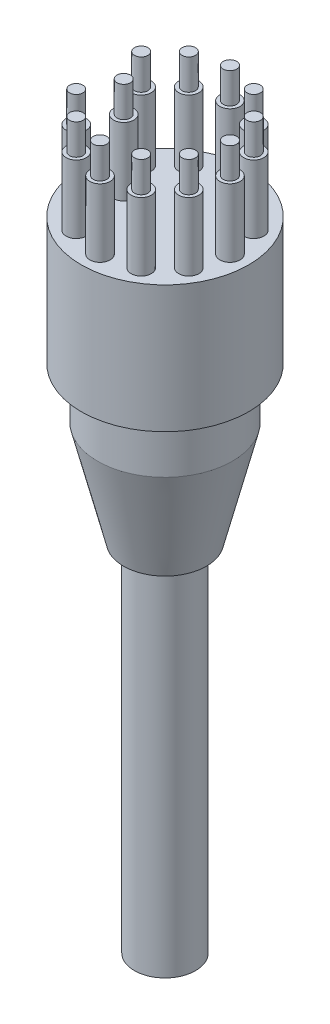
ISO-10303-21;
HEADER;
FILE_DESCRIPTION(('STEP AP214'),'2;1');
FILE_NAME('part.step','',(''),(''),'','','');
FILE_SCHEMA(('AUTOMOTIVE_DESIGN { 1 0 10303 214 1 1 1 1 }'));
ENDSEC;
DATA;
#1=APPLICATION_CONTEXT('core data for automotive mechanical design processes');
#2=APPLICATION_PROTOCOL_DEFINITION('international standard','automotive_design',2000,#1);
#3=PRODUCT_CONTEXT('',#1,'mechanical');
#4=PRODUCT('Part','Part','',(#3));
#5=PRODUCT_RELATED_PRODUCT_CATEGORY('part','',(#4));
#6=PRODUCT_DEFINITION_FORMATION('','',#4);
#7=PRODUCT_DEFINITION_CONTEXT('part definition',#1,'design');
#8=PRODUCT_DEFINITION('design','',#6,#7);
#9=PRODUCT_DEFINITION_SHAPE('','',#8);
#10=(LENGTH_UNIT() NAMED_UNIT(*) SI_UNIT(.MILLI.,.METRE.));
#11=(NAMED_UNIT(*) PLANE_ANGLE_UNIT() SI_UNIT($,.RADIAN.));
#12=(NAMED_UNIT(*) SI_UNIT($,.STERADIAN.) SOLID_ANGLE_UNIT());
#13=UNCERTAINTY_MEASURE_WITH_UNIT(LENGTH_MEASURE(1.E-05),#10,'distance_accuracy_value','');
#14=(GEOMETRIC_REPRESENTATION_CONTEXT(3) GLOBAL_UNCERTAINTY_ASSIGNED_CONTEXT((#13)) GLOBAL_UNIT_ASSIGNED_CONTEXT((#10,
#11,#12)) REPRESENTATION_CONTEXT('',''));
#15=CARTESIAN_POINT('',(0.,0.,0.));
#16=DIRECTION('',(0.,0.,1.));
#17=DIRECTION('',(1.,0.,0.));
#18=AXIS2_PLACEMENT_3D('',#15,#16,#17);
#19=CARTESIAN_POINT('',(0.,-15.5194,0.));
#20=DIRECTION('',(0.,-1.,0.));
#21=DIRECTION('',(0.,0.,-1.));
#22=AXIS2_PLACEMENT_3D('',#19,#20,#21);
#23=PLANE('',#22);
#24=CARTESIAN_POINT('',(0.,-15.5194,0.));
#25=DIRECTION('',(0.,-1.,0.));
#26=DIRECTION('',(0.,0.,-1.));
#27=AXIS2_PLACEMENT_3D('',#24,#25,#26);
#28=CIRCLE('',#27,6.18897899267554);
#29=CARTESIAN_POINT('',(0.,-15.5194,-6.18897899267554));
#30=VERTEX_POINT('',#29);
#31=EDGE_CURVE('E193',#30,#30,#28,.T.);
#32=ORIENTED_EDGE('',*,*,#31,.T.);
#33=EDGE_LOOP('',(#32));
#34=FACE_BOUND('',#33,.T.);
#35=CARTESIAN_POINT('',(0.,-15.5194,0.));
#36=DIRECTION('',(0.,-1.,0.));
#37=DIRECTION('',(0.,0.,-1.));
#38=AXIS2_PLACEMENT_3D('',#35,#36,#37);
#39=CIRCLE('',#38,4.572);
#40=CARTESIAN_POINT('',(0.,-15.5194,-4.572));
#41=VERTEX_POINT('',#40);
#42=EDGE_CURVE('E202',#41,#41,#39,.T.);
#43=ORIENTED_EDGE('',*,*,#42,.F.);
#44=EDGE_LOOP('',(#43));
#45=FACE_BOUND('',#44,.T.);
#46=ADVANCED_FACE('F34',(#34,#45),#23,.T.);
#47=CARTESIAN_POINT('',(-6.16752935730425,36.78,0.));
#48=DIRECTION('',(0.,1.,0.));
#49=DIRECTION('',(0.,0.,1.));
#50=AXIS2_PLACEMENT_3D('',#47,#48,#49);
#51=PLANE('',#50);
#52=CARTESIAN_POINT('',(-6.16752935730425,36.78,0.));
#53=DIRECTION('',(0.,1.,0.));
#54=DIRECTION('',(0.,0.,1.));
#55=AXIS2_PLACEMENT_3D('',#52,#53,#54);
#56=CIRCLE('',#55,1.5113);
#57=CARTESIAN_POINT('',(-6.16752935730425,36.78,1.5113));
#58=VERTEX_POINT('',#57);
#59=EDGE_CURVE('E181',#58,#58,#56,.T.);
#60=ORIENTED_EDGE('',*,*,#59,.T.);
#61=EDGE_LOOP('',(#60));
#62=FACE_BOUND('',#61,.T.);
#63=CARTESIAN_POINT('',(-6.16752935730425,36.78,0.));
#64=DIRECTION('',(0.,1.,0.));
#65=DIRECTION('',(0.,0.,1.));
#66=AXIS2_PLACEMENT_3D('',#63,#64,#65);
#67=CIRCLE('',#66,1.0033);
#68=CARTESIAN_POINT('',(-6.16752935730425,36.78,1.0033));
#69=VERTEX_POINT('',#68);
#70=EDGE_CURVE('E190',#69,#69,#67,.T.);
#71=ORIENTED_EDGE('',*,*,#70,.F.);
#72=EDGE_LOOP('',(#71));
#73=FACE_BOUND('',#72,.T.);
#74=ADVANCED_FACE('F218',(#62,#73),#51,.T.);
#75=CARTESIAN_POINT('',(0.,26.62,0.));
#76=DIRECTION('',(0.,1.,0.));
#77=DIRECTION('',(0.,0.,1.));
#78=AXIS2_PLACEMENT_3D('',#75,#76,#77);
#79=PLANE('',#78);
#80=CARTESIAN_POINT('',(8.40585907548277,26.62,-4.85312499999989));
#81=DIRECTION('',(0.,1.,0.));
#82=DIRECTION('',(0.499999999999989,0.,0.866025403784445));
#83=AXIS2_PLACEMENT_3D('',#80,#81,#82);
#84=CIRCLE('',#83,1.5113);
#85=CARTESIAN_POINT('',(9.16150907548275,26.62,-3.54430080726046));
#86=VERTEX_POINT('',#85);
#87=EDGE_CURVE('E118',#86,#86,#84,.T.);
#88=ORIENTED_EDGE('',*,*,#87,.F.);
#89=EDGE_LOOP('',(#88));
#90=FACE_BOUND('',#89,.T.);
#91=CARTESIAN_POINT('',(1.01667631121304E-13,26.62,-9.70625));
#92=DIRECTION('',(0.,1.,0.));
#93=DIRECTION('',(1.,0.,0.));
#94=AXIS2_PLACEMENT_3D('',#91,#92,#93);
#95=CIRCLE('',#94,1.5113);
#96=CARTESIAN_POINT('',(1.5113000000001,26.62,-9.70624999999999));
#97=VERTEX_POINT('',#96);
#98=EDGE_CURVE('E106',#97,#97,#95,.T.);
#99=ORIENTED_EDGE('',*,*,#98,.F.);
#100=EDGE_LOOP('',(#99));
#101=FACE_BOUND('',#100,.T.);
#102=CARTESIAN_POINT('',(-8.40585907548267,26.62,-4.85312500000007));
#103=DIRECTION('',(0.,1.,0.));
#104=DIRECTION('',(0.500000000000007,0.,-0.866025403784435));
#105=AXIS2_PLACEMENT_3D('',#102,#103,#104);
#106=CIRCLE('',#105,1.5113);
#107=CARTESIAN_POINT('',(-7.65020907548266,26.62,-6.16194919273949));
#108=VERTEX_POINT('',#107);
#109=EDGE_CURVE('E94',#108,#108,#106,.T.);
#110=ORIENTED_EDGE('',*,*,#109,.F.);
#111=EDGE_LOOP('',(#110));
#112=FACE_BOUND('',#111,.T.);
#113=CARTESIAN_POINT('',(-4.85312500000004,26.62,8.40585907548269));
#114=DIRECTION('',(0.,1.,0.));
#115=DIRECTION('',(-0.866025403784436,0.,-0.500000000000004));
#116=AXIS2_PLACEMENT_3D('',#113,#114,#115);
#117=CIRCLE('',#116,1.5113);
#118=CARTESIAN_POINT('',(-6.16194919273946,26.62,7.65020907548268));
#119=VERTEX_POINT('',#118);
#120=EDGE_CURVE('E82',#119,#119,#117,.T.);
#121=ORIENTED_EDGE('',*,*,#120,.F.);
#122=EDGE_LOOP('',(#121));
#123=FACE_BOUND('',#122,.T.);
#124=CARTESIAN_POINT('',(4.85312499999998,26.62,8.40585907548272));
#125=DIRECTION('',(0.,1.,0.));
#126=DIRECTION('',(-0.86602540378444,0.,0.499999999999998));
#127=AXIS2_PLACEMENT_3D('',#124,#125,#126);
#128=CIRCLE('',#127,1.5113);
#129=CARTESIAN_POINT('',(3.54430080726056,26.62,9.16150907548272));
#130=VERTEX_POINT('',#129);
#131=EDGE_CURVE('E70',#130,#130,#128,.T.);
#132=ORIENTED_EDGE('',*,*,#131,.F.);
#133=EDGE_LOOP('',(#132));
#134=FACE_BOUND('',#133,.T.);
#135=CARTESIAN_POINT('',(9.70625,26.62,0.));
#136=DIRECTION('',(0.,1.,0.));
#137=DIRECTION('',(0.,0.,1.));
#138=AXIS2_PLACEMENT_3D('',#135,#136,#137);
#139=CIRCLE('',#138,1.5113);
#140=CARTESIAN_POINT('',(9.70625,26.62,1.5113));
#141=VERTEX_POINT('',#140);
#142=EDGE_CURVE('E52',#141,#141,#139,.T.);
#143=ORIENTED_EDGE('',*,*,#142,.F.);
#144=EDGE_LOOP('',(#143));
#145=FACE_BOUND('',#144,.T.);
#146=CARTESIAN_POINT('',(0.,26.62,0.));
#147=DIRECTION('',(0.,1.,0.));
#148=DIRECTION('',(0.,0.,1.));
#149=AXIS2_PLACEMENT_3D('',#146,#147,#148);
#150=CIRCLE('',#149,12.5);
#151=CARTESIAN_POINT('',(0.,26.62,12.5));
#152=VERTEX_POINT('',#151);
#153=EDGE_CURVE('E41',#152,#152,#150,.T.);
#154=ORIENTED_EDGE('',*,*,#153,.T.);
#155=EDGE_LOOP('',(#154));
#156=FACE_BOUND('',#155,.T.);
#157=CARTESIAN_POINT('',(8.4058590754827,26.62,4.85312500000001));
#158=DIRECTION('',(0.,1.,0.));
#159=DIRECTION('',(-0.500000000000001,0.,0.866025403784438));
#160=AXIS2_PLACEMENT_3D('',#157,#158,#159);
#161=CIRCLE('',#160,1.5113);
#162=CARTESIAN_POINT('',(7.6502090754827,26.62,6.16194919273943));
#163=VERTEX_POINT('',#162);
#164=EDGE_CURVE('E64',#163,#163,#161,.T.);
#165=ORIENTED_EDGE('',*,*,#164,.F.);
#166=EDGE_LOOP('',(#165));
#167=FACE_BOUND('',#166,.T.);
#168=CARTESIAN_POINT('',(0.,26.62,9.70625));
#169=DIRECTION('',(0.,1.,0.));
#170=DIRECTION('',(-1.,0.,0.));
#171=AXIS2_PLACEMENT_3D('',#168,#169,#170);
#172=CIRCLE('',#171,1.5113);
#173=CARTESIAN_POINT('',(-1.51130000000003,26.62,9.70625));
#174=VERTEX_POINT('',#173);
#175=EDGE_CURVE('E76',#174,#174,#172,.T.);
#176=ORIENTED_EDGE('',*,*,#175,.F.);
#177=EDGE_LOOP('',(#176));
#178=FACE_BOUND('',#177,.T.);
#179=CARTESIAN_POINT('',(-8.40585907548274,26.62,4.85312499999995));
#180=DIRECTION('',(0.,1.,0.));
#181=DIRECTION('',(-0.499999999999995,0.,-0.866025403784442));
#182=AXIS2_PLACEMENT_3D('',#179,#180,#181);
#183=CIRCLE('',#182,1.5113);
#184=CARTESIAN_POINT('',(-9.16150907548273,26.62,3.54430080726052));
#185=VERTEX_POINT('',#184);
#186=EDGE_CURVE('E88',#185,#185,#183,.T.);
#187=ORIENTED_EDGE('',*,*,#186,.F.);
#188=EDGE_LOOP('',(#187));
#189=FACE_BOUND('',#188,.T.);
#190=CARTESIAN_POINT('',(-4.85312499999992,26.62,-8.40585907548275));
#191=DIRECTION('',(0.,1.,0.));
#192=DIRECTION('',(0.866025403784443,0.,-0.499999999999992));
#193=AXIS2_PLACEMENT_3D('',#190,#191,#192);
#194=CIRCLE('',#193,1.5113);
#195=CARTESIAN_POINT('',(-3.54430080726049,26.62,-9.16150907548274));
#196=VERTEX_POINT('',#195);
#197=EDGE_CURVE('E100',#196,#196,#194,.T.);
#198=ORIENTED_EDGE('',*,*,#197,.F.);
#199=EDGE_LOOP('',(#198));
#200=FACE_BOUND('',#199,.T.);
#201=CARTESIAN_POINT('',(4.8531250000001,26.62,-8.40585907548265));
#202=DIRECTION('',(0.,1.,0.));
#203=DIRECTION('',(0.866025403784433,0.,0.50000000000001));
#204=AXIS2_PLACEMENT_3D('',#201,#202,#203);
#205=CIRCLE('',#204,1.5113);
#206=CARTESIAN_POINT('',(6.16194919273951,26.62,-7.65020907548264));
#207=VERTEX_POINT('',#206);
#208=EDGE_CURVE('E112',#207,#207,#205,.T.);
#209=ORIENTED_EDGE('',*,*,#208,.F.);
#210=EDGE_LOOP('',(#209));
#211=FACE_BOUND('',#210,.T.);
#212=CARTESIAN_POINT('',(-6.16752935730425,26.62,0.));
#213=DIRECTION('',(0.,1.,0.));
#214=DIRECTION('',(0.,0.,1.));
#215=AXIS2_PLACEMENT_3D('',#212,#213,#214);
#216=CIRCLE('',#215,1.5113);
#217=CARTESIAN_POINT('',(-6.16752935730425,26.62,1.5113));
#218=VERTEX_POINT('',#217);
#219=EDGE_CURVE('E184',#218,#218,#216,.T.);
#220=ORIENTED_EDGE('',*,*,#219,.F.);
#221=EDGE_LOOP('',(#220));
#222=FACE_BOUND('',#221,.T.);
#223=ADVANCED_FACE('F224',(#90,#101,#112,#123,#134,#145,#156,#167,#178,#189,#200,#211,#222),#79,.T.);
#224=CARTESIAN_POINT('',(8.40585907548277,36.78,-4.85312499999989));
#225=DIRECTION('',(0.,1.,0.));
#226=DIRECTION('',(0.499999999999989,0.,0.866025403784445));
#227=AXIS2_PLACEMENT_3D('',#224,#225,#226);
#228=PLANE('',#227);
#229=CARTESIAN_POINT('',(8.40585907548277,36.78,-4.85312499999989));
#230=DIRECTION('',(0.,1.,0.));
#231=DIRECTION('',(0.499999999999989,0.,0.866025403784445));
#232=AXIS2_PLACEMENT_3D('',#229,#230,#231);
#233=CIRCLE('',#232,1.5113);
#234=CARTESIAN_POINT('',(9.16150907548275,36.78,-3.54430080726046));
#235=VERTEX_POINT('',#234);
#236=EDGE_CURVE('E115',#235,#235,#233,.T.);
#237=ORIENTED_EDGE('',*,*,#236,.T.);
#238=EDGE_LOOP('',(#237));
#239=FACE_BOUND('',#238,.T.);
#240=CARTESIAN_POINT('',(8.40585907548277,36.78,-4.85312499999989));
#241=DIRECTION('',(0.,1.,0.));
#242=DIRECTION('',(0.499999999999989,0.,0.866025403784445));
#243=AXIS2_PLACEMENT_3D('',#240,#241,#242);
#244=CIRCLE('',#243,1.0033);
#245=CARTESIAN_POINT('',(8.90750907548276,36.78,-3.98424171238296));
#246=VERTEX_POINT('',#245);
#247=EDGE_CURVE('E178',#246,#246,#244,.T.);
#248=ORIENTED_EDGE('',*,*,#247,.F.);
#249=EDGE_LOOP('',(#248));
#250=FACE_BOUND('',#249,.T.);
#251=ADVANCED_FACE('F325',(#239,#250),#228,.T.);
#252=CARTESIAN_POINT('',(4.8531250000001,36.78,-8.40585907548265));
#253=DIRECTION('',(0.,1.,0.));
#254=DIRECTION('',(0.866025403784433,0.,0.50000000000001));
#255=AXIS2_PLACEMENT_3D('',#252,#253,#254);
#256=PLANE('',#255);
#257=CARTESIAN_POINT('',(4.8531250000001,36.78,-8.40585907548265));
#258=DIRECTION('',(0.,1.,0.));
#259=DIRECTION('',(0.866025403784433,0.,0.50000000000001));
#260=AXIS2_PLACEMENT_3D('',#257,#258,#259);
#261=CIRCLE('',#260,1.5113);
#262=CARTESIAN_POINT('',(6.16194919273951,36.78,-7.65020907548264));
#263=VERTEX_POINT('',#262);
#264=EDGE_CURVE('E109',#263,#263,#261,.T.);
#265=ORIENTED_EDGE('',*,*,#264,.T.);
#266=EDGE_LOOP('',(#265));
#267=FACE_BOUND('',#266,.T.);
#268=CARTESIAN_POINT('',(4.8531250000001,36.78,-8.40585907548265));
#269=DIRECTION('',(0.,1.,0.));
#270=DIRECTION('',(0.866025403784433,0.,0.50000000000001));
#271=AXIS2_PLACEMENT_3D('',#268,#269,#270);
#272=CIRCLE('',#271,1.0033);
#273=CARTESIAN_POINT('',(5.72200828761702,36.78,-7.90420907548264));
#274=VERTEX_POINT('',#273);
#275=EDGE_CURVE('E172',#274,#274,#272,.T.);
#276=ORIENTED_EDGE('',*,*,#275,.F.);
#277=EDGE_LOOP('',(#276));
#278=FACE_BOUND('',#277,.T.);
#279=ADVANCED_FACE('F328',(#267,#278),#256,.T.);
#280=CARTESIAN_POINT('',(1.01667631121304E-13,36.78,-9.70625));
#281=DIRECTION('',(0.,1.,0.));
#282=DIRECTION('',(1.,0.,0.));
#283=AXIS2_PLACEMENT_3D('',#280,#281,#282);
#284=PLANE('',#283);
#285=CARTESIAN_POINT('',(1.01667631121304E-13,36.78,-9.70625));
#286=DIRECTION('',(0.,1.,0.));
#287=DIRECTION('',(1.,0.,0.));
#288=AXIS2_PLACEMENT_3D('',#285,#286,#287);
#289=CIRCLE('',#288,1.5113);
#290=CARTESIAN_POINT('',(1.5113000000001,36.78,-9.70624999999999));
#291=VERTEX_POINT('',#290);
#292=EDGE_CURVE('E103',#291,#291,#289,.T.);
#293=ORIENTED_EDGE('',*,*,#292,.T.);
#294=EDGE_LOOP('',(#293));
#295=FACE_BOUND('',#294,.T.);
#296=CARTESIAN_POINT('',(1.01667631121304E-13,36.78,-9.70625));
#297=DIRECTION('',(0.,1.,0.));
#298=DIRECTION('',(1.,0.,0.));
#299=AXIS2_PLACEMENT_3D('',#296,#297,#298);
#300=CIRCLE('',#299,1.0033);
#301=CARTESIAN_POINT('',(1.0033000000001,36.78,-9.70624999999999));
#302=VERTEX_POINT('',#301);
#303=EDGE_CURVE('E166',#302,#302,#300,.T.);
#304=ORIENTED_EDGE('',*,*,#303,.F.);
#305=EDGE_LOOP('',(#304));
#306=FACE_BOUND('',#305,.T.);
#307=ADVANCED_FACE('F336',(#295,#306),#284,.T.);
#308=CARTESIAN_POINT('',(-4.85312499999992,36.78,-8.40585907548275));
#309=DIRECTION('',(0.,1.,0.));
#310=DIRECTION('',(0.866025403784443,0.,-0.499999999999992));
#311=AXIS2_PLACEMENT_3D('',#308,#309,#310);
#312=PLANE('',#311);
#313=CARTESIAN_POINT('',(-4.85312499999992,36.78,-8.40585907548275));
#314=DIRECTION('',(0.,1.,0.));
#315=DIRECTION('',(0.866025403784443,0.,-0.499999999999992));
#316=AXIS2_PLACEMENT_3D('',#313,#314,#315);
#317=CIRCLE('',#316,1.5113);
#318=CARTESIAN_POINT('',(-3.54430080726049,36.78,-9.16150907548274));
#319=VERTEX_POINT('',#318);
#320=EDGE_CURVE('E97',#319,#319,#317,.T.);
#321=ORIENTED_EDGE('',*,*,#320,.T.);
#322=EDGE_LOOP('',(#321));
#323=FACE_BOUND('',#322,.T.);
#324=CARTESIAN_POINT('',(-4.85312499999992,36.78,-8.40585907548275));
#325=DIRECTION('',(0.,1.,0.));
#326=DIRECTION('',(0.866025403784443,0.,-0.499999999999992));
#327=AXIS2_PLACEMENT_3D('',#324,#325,#326);
#328=CIRCLE('',#327,1.0033);
#329=CARTESIAN_POINT('',(-3.98424171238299,36.78,-8.90750907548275));
#330=VERTEX_POINT('',#329);
#331=EDGE_CURVE('E160',#330,#330,#328,.T.);
#332=ORIENTED_EDGE('',*,*,#331,.F.);
#333=EDGE_LOOP('',(#332));
#334=FACE_BOUND('',#333,.T.);
#335=ADVANCED_FACE('F344',(#323,#334),#312,.T.);
#336=CARTESIAN_POINT('',(-8.40585907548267,36.78,-4.85312500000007));
#337=DIRECTION('',(0.,1.,0.));
#338=DIRECTION('',(0.500000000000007,0.,-0.866025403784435));
#339=AXIS2_PLACEMENT_3D('',#336,#337,#338);
#340=PLANE('',#339);
#341=CARTESIAN_POINT('',(-8.40585907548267,36.78,-4.85312500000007));
#342=DIRECTION('',(0.,1.,0.));
#343=DIRECTION('',(0.500000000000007,0.,-0.866025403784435));
#344=AXIS2_PLACEMENT_3D('',#341,#342,#343);
#345=CIRCLE('',#344,1.5113);
#346=CARTESIAN_POINT('',(-7.65020907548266,36.78,-6.16194919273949));
#347=VERTEX_POINT('',#346);
#348=EDGE_CURVE('E91',#347,#347,#345,.T.);
#349=ORIENTED_EDGE('',*,*,#348,.T.);
#350=EDGE_LOOP('',(#349));
#351=FACE_BOUND('',#350,.T.);
#352=CARTESIAN_POINT('',(-8.40585907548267,36.78,-4.85312500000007));
#353=DIRECTION('',(0.,1.,0.));
#354=DIRECTION('',(0.500000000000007,0.,-0.866025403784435));
#355=AXIS2_PLACEMENT_3D('',#352,#353,#354);
#356=CIRCLE('',#355,1.0033);
#357=CARTESIAN_POINT('',(-7.90420907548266,36.78,-5.72200828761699));
#358=VERTEX_POINT('',#357);
#359=EDGE_CURVE('E154',#358,#358,#356,.T.);
#360=ORIENTED_EDGE('',*,*,#359,.F.);
#361=EDGE_LOOP('',(#360));
#362=FACE_BOUND('',#361,.T.);
#363=ADVANCED_FACE('F352',(#351,#362),#340,.T.);
#364=CARTESIAN_POINT('',(-8.40585907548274,36.78,4.85312499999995));
#365=DIRECTION('',(0.,1.,0.));
#366=DIRECTION('',(-0.499999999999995,0.,-0.866025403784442));
#367=AXIS2_PLACEMENT_3D('',#364,#365,#366);
#368=PLANE('',#367);
#369=CARTESIAN_POINT('',(-8.40585907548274,36.78,4.85312499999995));
#370=DIRECTION('',(0.,1.,0.));
#371=DIRECTION('',(-0.499999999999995,0.,-0.866025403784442));
#372=AXIS2_PLACEMENT_3D('',#369,#370,#371);
#373=CIRCLE('',#372,1.5113);
#374=CARTESIAN_POINT('',(-9.16150907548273,36.78,3.54430080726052));
#375=VERTEX_POINT('',#374);
#376=EDGE_CURVE('E85',#375,#375,#373,.T.);
#377=ORIENTED_EDGE('',*,*,#376,.T.);
#378=EDGE_LOOP('',(#377));
#379=FACE_BOUND('',#378,.T.);
#380=CARTESIAN_POINT('',(-8.40585907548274,36.78,4.85312499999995));
#381=DIRECTION('',(0.,1.,0.));
#382=DIRECTION('',(-0.499999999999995,0.,-0.866025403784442));
#383=AXIS2_PLACEMENT_3D('',#380,#381,#382);
#384=CIRCLE('',#383,1.0033);
#385=CARTESIAN_POINT('',(-8.90750907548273,36.78,3.98424171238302));
#386=VERTEX_POINT('',#385);
#387=EDGE_CURVE('E148',#386,#386,#384,.T.);
#388=ORIENTED_EDGE('',*,*,#387,.F.);
#389=EDGE_LOOP('',(#388));
#390=FACE_BOUND('',#389,.T.);
#391=ADVANCED_FACE('F360',(#379,#390),#368,.T.);
#392=CARTESIAN_POINT('',(-4.85312500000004,36.78,8.40585907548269));
#393=DIRECTION('',(0.,1.,0.));
#394=DIRECTION('',(-0.866025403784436,0.,-0.500000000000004));
#395=AXIS2_PLACEMENT_3D('',#392,#393,#394);
#396=PLANE('',#395);
#397=CARTESIAN_POINT('',(-4.85312500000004,36.78,8.40585907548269));
#398=DIRECTION('',(0.,1.,0.));
#399=DIRECTION('',(-0.866025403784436,0.,-0.500000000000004));
#400=AXIS2_PLACEMENT_3D('',#397,#398,#399);
#401=CIRCLE('',#400,1.5113);
#402=CARTESIAN_POINT('',(-6.16194919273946,36.78,7.65020907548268));
#403=VERTEX_POINT('',#402);
#404=EDGE_CURVE('E79',#403,#403,#401,.T.);
#405=ORIENTED_EDGE('',*,*,#404,.T.);
#406=EDGE_LOOP('',(#405));
#407=FACE_BOUND('',#406,.T.);
#408=CARTESIAN_POINT('',(-4.85312500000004,36.78,8.40585907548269));
#409=DIRECTION('',(0.,1.,0.));
#410=DIRECTION('',(-0.866025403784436,0.,-0.500000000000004));
#411=AXIS2_PLACEMENT_3D('',#408,#409,#410);
#412=CIRCLE('',#411,1.0033);
#413=CARTESIAN_POINT('',(-5.72200828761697,36.78,7.90420907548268));
#414=VERTEX_POINT('',#413);
#415=EDGE_CURVE('E142',#414,#414,#412,.T.);
#416=ORIENTED_EDGE('',*,*,#415,.F.);
#417=EDGE_LOOP('',(#416));
#418=FACE_BOUND('',#417,.T.);
#419=ADVANCED_FACE('F368',(#407,#418),#396,.T.);
#420=CARTESIAN_POINT('',(0.,36.78,9.70625));
#421=DIRECTION('',(0.,1.,0.));
#422=DIRECTION('',(-1.,0.,0.));
#423=AXIS2_PLACEMENT_3D('',#420,#421,#422);
#424=PLANE('',#423);
#425=CARTESIAN_POINT('',(0.,36.78,9.70625));
#426=DIRECTION('',(0.,1.,0.));
#427=DIRECTION('',(-1.,0.,0.));
#428=AXIS2_PLACEMENT_3D('',#425,#426,#427);
#429=CIRCLE('',#428,1.5113);
#430=CARTESIAN_POINT('',(-1.51130000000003,36.78,9.70625));
#431=VERTEX_POINT('',#430);
#432=EDGE_CURVE('E73',#431,#431,#429,.T.);
#433=ORIENTED_EDGE('',*,*,#432,.T.);
#434=EDGE_LOOP('',(#433));
#435=FACE_BOUND('',#434,.T.);
#436=CARTESIAN_POINT('',(0.,36.78,9.70625));
#437=DIRECTION('',(0.,1.,0.));
#438=DIRECTION('',(-1.,0.,0.));
#439=AXIS2_PLACEMENT_3D('',#436,#437,#438);
#440=CIRCLE('',#439,1.0033);
#441=CARTESIAN_POINT('',(-1.00330000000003,36.78,9.70625));
#442=VERTEX_POINT('',#441);
#443=EDGE_CURVE('E136',#442,#442,#440,.T.);
#444=ORIENTED_EDGE('',*,*,#443,.F.);
#445=EDGE_LOOP('',(#444));
#446=FACE_BOUND('',#445,.T.);
#447=ADVANCED_FACE('F376',(#435,#446),#424,.T.);
#448=CARTESIAN_POINT('',(4.85312499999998,36.78,8.40585907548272));
#449=DIRECTION('',(0.,1.,0.));
#450=DIRECTION('',(-0.86602540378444,0.,0.499999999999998));
#451=AXIS2_PLACEMENT_3D('',#448,#449,#450);
#452=PLANE('',#451);
#453=CARTESIAN_POINT('',(4.85312499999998,36.78,8.40585907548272));
#454=DIRECTION('',(0.,1.,0.));
#455=DIRECTION('',(-0.86602540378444,0.,0.499999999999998));
#456=AXIS2_PLACEMENT_3D('',#453,#454,#455);
#457=CIRCLE('',#456,1.5113);
#458=CARTESIAN_POINT('',(3.54430080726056,36.78,9.16150907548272));
#459=VERTEX_POINT('',#458);
#460=EDGE_CURVE('E67',#459,#459,#457,.T.);
#461=ORIENTED_EDGE('',*,*,#460,.T.);
#462=EDGE_LOOP('',(#461));
#463=FACE_BOUND('',#462,.T.);
#464=CARTESIAN_POINT('',(4.85312499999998,36.78,8.40585907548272));
#465=DIRECTION('',(0.,1.,0.));
#466=DIRECTION('',(-0.86602540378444,0.,0.499999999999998));
#467=AXIS2_PLACEMENT_3D('',#464,#465,#466);
#468=CIRCLE('',#467,1.0033);
#469=CARTESIAN_POINT('',(3.98424171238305,36.78,8.90750907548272));
#470=VERTEX_POINT('',#469);
#471=EDGE_CURVE('E130',#470,#470,#468,.T.);
#472=ORIENTED_EDGE('',*,*,#471,.F.);
#473=EDGE_LOOP('',(#472));
#474=FACE_BOUND('',#473,.T.);
#475=ADVANCED_FACE('F384',(#463,#474),#452,.T.);
#476=CARTESIAN_POINT('',(8.4058590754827,36.78,4.85312500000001));
#477=DIRECTION('',(0.,1.,0.));
#478=DIRECTION('',(-0.500000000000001,0.,0.866025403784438));
#479=AXIS2_PLACEMENT_3D('',#476,#477,#478);
#480=PLANE('',#479);
#481=CARTESIAN_POINT('',(8.4058590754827,36.78,4.85312500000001));
#482=DIRECTION('',(0.,1.,0.));
#483=DIRECTION('',(-0.500000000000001,0.,0.866025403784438));
#484=AXIS2_PLACEMENT_3D('',#481,#482,#483);
#485=CIRCLE('',#484,1.5113);
#486=CARTESIAN_POINT('',(7.6502090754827,36.78,6.16194919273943));
#487=VERTEX_POINT('',#486);
#488=EDGE_CURVE('E61',#487,#487,#485,.T.);
#489=ORIENTED_EDGE('',*,*,#488,.T.);
#490=EDGE_LOOP('',(#489));
#491=FACE_BOUND('',#490,.T.);
#492=CARTESIAN_POINT('',(8.4058590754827,36.78,4.85312500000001));
#493=DIRECTION('',(0.,1.,0.));
#494=DIRECTION('',(-0.500000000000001,0.,0.866025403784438));
#495=AXIS2_PLACEMENT_3D('',#492,#493,#494);
#496=CIRCLE('',#495,1.0033);
#497=CARTESIAN_POINT('',(7.9042090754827,36.78,5.72200828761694));
#498=VERTEX_POINT('',#497);
#499=EDGE_CURVE('E124',#498,#498,#496,.T.);
#500=ORIENTED_EDGE('',*,*,#499,.F.);
#501=EDGE_LOOP('',(#500));
#502=FACE_BOUND('',#501,.T.);
#503=ADVANCED_FACE('F392',(#491,#502),#480,.T.);
#504=CARTESIAN_POINT('',(9.70625,36.78,0.));
#505=DIRECTION('',(0.,1.,0.));
#506=DIRECTION('',(0.,0.,1.));
#507=AXIS2_PLACEMENT_3D('',#504,#505,#506);
#508=PLANE('',#507);
#509=CARTESIAN_POINT('',(9.70625,36.78,0.));
#510=DIRECTION('',(0.,1.,0.));
#511=DIRECTION('',(0.,0.,1.));
#512=AXIS2_PLACEMENT_3D('',#509,#510,#511);
#513=CIRCLE('',#512,1.5113);
#514=CARTESIAN_POINT('',(9.70625,36.78,1.5113));
#515=VERTEX_POINT('',#514);
#516=EDGE_CURVE('E50',#515,#515,#513,.T.);
#517=ORIENTED_EDGE('',*,*,#516,.T.);
#518=EDGE_LOOP('',(#517));
#519=FACE_BOUND('',#518,.T.);
#520=CARTESIAN_POINT('',(9.70625,36.78,0.));
#521=DIRECTION('',(0.,1.,0.));
#522=DIRECTION('',(0.,0.,1.));
#523=AXIS2_PLACEMENT_3D('',#520,#521,#522);
#524=CIRCLE('',#523,1.0033);
#525=CARTESIAN_POINT('',(9.70625,36.78,1.0033));
#526=VERTEX_POINT('',#525);
#527=EDGE_CURVE('E58',#526,#526,#524,.T.);
#528=ORIENTED_EDGE('',*,*,#527,.F.);
#529=EDGE_LOOP('',(#528));
#530=FACE_BOUND('',#529,.T.);
#531=ADVANCED_FACE('F400',(#519,#530),#508,.T.);
#532=CARTESIAN_POINT('',(0.,7.62,0.));
#533=DIRECTION('',(0.,-1.,0.));
#534=DIRECTION('',(0.,0.,-1.));
#535=AXIS2_PLACEMENT_3D('',#532,#533,#534);
#536=CYLINDRICAL_SURFACE('',#535,10.0584);
#537=CARTESIAN_POINT('',(0.,7.62,0.));
#538=DIRECTION('',(0.,1.,0.));
#539=DIRECTION('',(0.,0.,1.));
#540=AXIS2_PLACEMENT_3D('',#537,#538,#539);
#541=CIRCLE('',#540,10.0584);
#542=CARTESIAN_POINT('',(0.,7.62,-10.0584));
#543=VERTEX_POINT('',#542);
#544=EDGE_CURVE('E10',#543,#543,#541,.T.);
#545=CARTESIAN_POINT('',(0.,0.,0.));
#546=DIRECTION('',(0.,-1.,0.));
#547=DIRECTION('',(0.,0.,-1.));
#548=AXIS2_PLACEMENT_3D('',#545,#546,#547);
#549=CIRCLE('',#548,10.0584);
#550=CARTESIAN_POINT('',(0.,0.,-10.0584));
#551=VERTEX_POINT('',#550);
#552=EDGE_CURVE('E198',#551,#551,#549,.T.);
#553=CARTESIAN_POINT('',(0.,7.62,-10.0584));
#554=CARTESIAN_POINT('',(0.,7.540625,-10.0584));
#555=CARTESIAN_POINT('',(0.,7.46125,-10.0584));
#556=CARTESIAN_POINT('',(0.,7.3025,-10.0584));
#557=CARTESIAN_POINT('',(0.,7.223125,-10.0584));
#558=CARTESIAN_POINT('',(0.,7.064375,-10.0584));
#559=CARTESIAN_POINT('',(0.,6.985,-10.0584));
#560=CARTESIAN_POINT('',(0.,6.82625,-10.0584));
#561=CARTESIAN_POINT('',(0.,6.746875,-10.0584));
#562=CARTESIAN_POINT('',(0.,6.588125,-10.0584));
#563=CARTESIAN_POINT('',(0.,6.50875,-10.0584));
#564=CARTESIAN_POINT('',(0.,6.35,-10.0584));
#565=CARTESIAN_POINT('',(0.,6.270625,-10.0584));
#566=CARTESIAN_POINT('',(0.,6.111875,-10.0584));
#567=CARTESIAN_POINT('',(0.,6.0325,-10.0584));
#568=CARTESIAN_POINT('',(0.,5.87375,-10.0584));
#569=CARTESIAN_POINT('',(0.,5.794375,-10.0584));
#570=CARTESIAN_POINT('',(0.,5.635625,-10.0584));
#571=CARTESIAN_POINT('',(0.,5.55625,-10.0584));
#572=CARTESIAN_POINT('',(0.,5.3975,-10.0584));
#573=CARTESIAN_POINT('',(0.,5.318125,-10.0584));
#574=CARTESIAN_POINT('',(0.,5.159375,-10.0584));
#575=CARTESIAN_POINT('',(0.,5.08,-10.0584));
#576=CARTESIAN_POINT('',(0.,4.92125,-10.0584));
#577=CARTESIAN_POINT('',(0.,4.841875,-10.0584));
#578=CARTESIAN_POINT('',(0.,4.683125,-10.0584));
#579=CARTESIAN_POINT('',(0.,4.60375,-10.0584));
#580=CARTESIAN_POINT('',(0.,4.445,-10.0584));
#581=CARTESIAN_POINT('',(0.,4.365625,-10.0584));
#582=CARTESIAN_POINT('',(0.,4.206875,-10.0584));
#583=CARTESIAN_POINT('',(0.,4.1275,-10.0584));
#584=CARTESIAN_POINT('',(0.,3.96875,-10.0584));
#585=CARTESIAN_POINT('',(0.,3.889375,-10.0584));
#586=CARTESIAN_POINT('',(0.,3.730625,-10.0584));
#587=CARTESIAN_POINT('',(0.,3.65125,-10.0584));
#588=CARTESIAN_POINT('',(0.,3.4925,-10.0584));
#589=CARTESIAN_POINT('',(0.,3.413125,-10.0584));
#590=CARTESIAN_POINT('',(0.,3.254375,-10.0584));
#591=CARTESIAN_POINT('',(0.,3.175,-10.0584));
#592=CARTESIAN_POINT('',(0.,3.01625,-10.0584));
#593=CARTESIAN_POINT('',(0.,2.936875,-10.0584));
#594=CARTESIAN_POINT('',(0.,2.778125,-10.0584));
#595=CARTESIAN_POINT('',(0.,2.69875,-10.0584));
#596=CARTESIAN_POINT('',(0.,2.54,-10.0584));
#597=CARTESIAN_POINT('',(0.,2.460625,-10.0584));
#598=CARTESIAN_POINT('',(0.,2.301875,-10.0584));
#599=CARTESIAN_POINT('',(0.,2.2225,-10.0584));
#600=CARTESIAN_POINT('',(0.,2.06375,-10.0584));
#601=CARTESIAN_POINT('',(0.,1.984375,-10.0584));
#602=CARTESIAN_POINT('',(0.,1.825625,-10.0584));
#603=CARTESIAN_POINT('',(0.,1.74625,-10.0584));
#604=CARTESIAN_POINT('',(0.,1.5875,-10.0584));
#605=CARTESIAN_POINT('',(0.,1.508125,-10.0584));
#606=CARTESIAN_POINT('',(0.,1.349375,-10.0584));
#607=CARTESIAN_POINT('',(0.,1.27,-10.0584));
#608=CARTESIAN_POINT('',(0.,1.11125,-10.0584));
#609=CARTESIAN_POINT('',(0.,1.031875,-10.0584));
#610=CARTESIAN_POINT('',(0.,0.873125,-10.0584));
#611=CARTESIAN_POINT('',(0.,0.79375,-10.0584));
#612=CARTESIAN_POINT('',(0.,0.635,-10.0584));
#613=CARTESIAN_POINT('',(0.,0.555625,-10.0584));
#614=CARTESIAN_POINT('',(0.,0.396875,-10.0584));
#615=CARTESIAN_POINT('',(0.,0.3175,-10.0584));
#616=CARTESIAN_POINT('',(0.,0.15875,-10.0584));
#617=CARTESIAN_POINT('',(0.,0.0793749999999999,-10.0584));
#618=CARTESIAN_POINT('',(0.,0.,-10.0584));
#619=B_SPLINE_CURVE_WITH_KNOTS('',3,(#553,#554,#555,#556,#557,#558,#559,#560,#561,#562,#563,
#564,#565,#566,#567,#568,#569,#570,#571,#572,#573,#574,#575,#576,#577,#578,#579,#580,#581,#582,
#583,#584,#585,#586,#587,#588,#589,#590,#591,#592,#593,#594,#595,#596,#597,#598,#599,#600,#601,
#602,#603,#604,#605,#606,#607,#608,#609,#610,#611,#612,#613,#614,#615,#616,#617,#618),
.UNSPECIFIED.,.F.,.F.,(4,2,2,2,2,2,2,2,2,2,2,2,2,2,2,2,2,2,2,2,2,2,2,2,2,2,2,2,2,2,2,2,4),(0.,
0.238125,0.47625,0.714375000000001,0.9525,1.190625,1.42875,1.666875,1.905,2.143125,2.38125,
2.619375,2.8575,3.095625,3.33375,3.571875,3.81,4.048125,4.28625,4.524375,4.7625,5.000625,
5.23875,5.476875,5.715,5.953125,6.19125,6.429375,6.6675,6.905625,7.14375,7.381875,7.62),.UNSPECIFIED.);
#620=EDGE_CURVE('BSEAM36',#543,#551,#619,.T.);
#621=ORIENTED_EDGE('',*,*,#544,.F.);
#622=ORIENTED_EDGE('',*,*,#552,.F.);
#623=ORIENTED_EDGE('',*,*,#620,.T.);
#624=ORIENTED_EDGE('',*,*,#620,.F.);
#625=EDGE_LOOP('',(#621,#623,#622,#624));
#626=FACE_BOUND('',#625,.T.);
#627=ADVANCED_FACE('F36',(#626),#536,.T.);
#628=CARTESIAN_POINT('',(0.,7.62,0.));
#629=DIRECTION('',(0.,1.,0.));
#630=DIRECTION('',(0.,0.,1.));
#631=AXIS2_PLACEMENT_3D('',#628,#629,#630);
#632=PLANE('',#631);
#633=CARTESIAN_POINT('',(0.,7.62,0.));
#634=DIRECTION('',(0.,1.,0.));
#635=DIRECTION('',(0.,0.,1.));
#636=AXIS2_PLACEMENT_3D('',#633,#634,#635);
#637=CIRCLE('',#636,12.5);
#638=CARTESIAN_POINT('',(0.,7.62,12.5));
#639=VERTEX_POINT('',#638);
#640=EDGE_CURVE('E45',#639,#639,#637,.T.);
#641=ORIENTED_EDGE('',*,*,#640,.F.);
#642=EDGE_LOOP('',(#641));
#643=FACE_BOUND('',#642,.T.);
#644=ORIENTED_EDGE('',*,*,#544,.T.);
#645=EDGE_LOOP('',(#644));
#646=FACE_BOUND('',#645,.T.);
#647=ADVANCED_FACE('F424',(#643,#646),#632,.F.);
#648=CARTESIAN_POINT('',(0.,26.62,0.));
#649=DIRECTION('',(0.,-1.,0.));
#650=DIRECTION('',(0.,0.,-1.));
#651=AXIS2_PLACEMENT_3D('',#648,#649,#650);
#652=CYLINDRICAL_SURFACE('',#651,12.5);
#653=ORIENTED_EDGE('',*,*,#153,.F.);
#654=EDGE_LOOP('',(#653));
#655=FACE_BOUND('',#654,.T.);
#656=ORIENTED_EDGE('',*,*,#640,.T.);
#657=EDGE_LOOP('',(#656));
#658=FACE_BOUND('',#657,.T.);
#659=ADVANCED_FACE('F419',(#655,#658),#652,.T.);
#660=CARTESIAN_POINT('',(9.70625,36.78,0.));
#661=DIRECTION('',(0.,-1.,0.));
#662=DIRECTION('',(0.,0.,-1.));
#663=AXIS2_PLACEMENT_3D('',#660,#661,#662);
#664=CYLINDRICAL_SURFACE('',#663,1.5113);
#665=ORIENTED_EDGE('',*,*,#516,.F.);
#666=EDGE_LOOP('',(#665));
#667=FACE_BOUND('',#666,.T.);
#668=ORIENTED_EDGE('',*,*,#142,.T.);
#669=EDGE_LOOP('',(#668));
#670=FACE_BOUND('',#669,.T.);
#671=ADVANCED_FACE('F412',(#667,#670),#664,.T.);
#672=CARTESIAN_POINT('',(9.70625,41.352,0.));
#673=DIRECTION('',(0.,-1.,0.));
#674=DIRECTION('',(0.,0.,-1.));
#675=AXIS2_PLACEMENT_3D('',#672,#673,#674);
#676=CYLINDRICAL_SURFACE('',#675,1.0033);
#677=CARTESIAN_POINT('',(9.70625,41.352,0.));
#678=DIRECTION('',(0.,1.,0.));
#679=DIRECTION('',(0.,0.,1.));
#680=AXIS2_PLACEMENT_3D('',#677,#678,#679);
#681=CIRCLE('',#680,1.0033);
#682=CARTESIAN_POINT('',(9.70625,41.352,1.0033));
#683=VERTEX_POINT('',#682);
#684=EDGE_CURVE('E55',#683,#683,#681,.T.);
#685=ORIENTED_EDGE('',*,*,#684,.F.);
#686=EDGE_LOOP('',(#685));
#687=FACE_BOUND('',#686,.T.);
#688=ORIENTED_EDGE('',*,*,#527,.T.);
#689=EDGE_LOOP('',(#688));
#690=FACE_BOUND('',#689,.T.);
#691=ADVANCED_FACE('F408',(#687,#690),#676,.T.);
#692=CARTESIAN_POINT('',(9.70625,41.352,0.));
#693=DIRECTION('',(0.,1.,0.));
#694=DIRECTION('',(0.,0.,1.));
#695=AXIS2_PLACEMENT_3D('',#692,#693,#694);
#696=PLANE('',#695);
#697=ORIENTED_EDGE('',*,*,#684,.T.);
#698=EDGE_LOOP('',(#697));
#699=FACE_BOUND('',#698,.T.);
#700=ADVANCED_FACE('F404',(#699),#696,.T.);
#701=CARTESIAN_POINT('',(8.4058590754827,36.78,4.85312500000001));
#702=DIRECTION('',(0.,-1.,0.));
#703=DIRECTION('',(0.,0.,-1.));
#704=AXIS2_PLACEMENT_3D('',#701,#702,#703);
#705=CYLINDRICAL_SURFACE('',#704,1.5113);
#706=ORIENTED_EDGE('',*,*,#488,.F.);
#707=EDGE_LOOP('',(#706));
#708=FACE_BOUND('',#707,.T.);
#709=ORIENTED_EDGE('',*,*,#164,.T.);
#710=EDGE_LOOP('',(#709));
#711=FACE_BOUND('',#710,.T.);
#712=ADVANCED_FACE('F396',(#708,#711),#705,.T.);
#713=CARTESIAN_POINT('',(4.85312499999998,36.78,8.40585907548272));
#714=DIRECTION('',(0.,-1.,0.));
#715=DIRECTION('',(0.,0.,-1.));
#716=AXIS2_PLACEMENT_3D('',#713,#714,#715);
#717=CYLINDRICAL_SURFACE('',#716,1.5113);
#718=ORIENTED_EDGE('',*,*,#460,.F.);
#719=EDGE_LOOP('',(#718));
#720=FACE_BOUND('',#719,.T.);
#721=ORIENTED_EDGE('',*,*,#131,.T.);
#722=EDGE_LOOP('',(#721));
#723=FACE_BOUND('',#722,.T.);
#724=ADVANCED_FACE('F388',(#720,#723),#717,.T.);
#725=CARTESIAN_POINT('',(0.,36.78,9.70625));
#726=DIRECTION('',(0.,-1.,0.));
#727=DIRECTION('',(0.,0.,-1.));
#728=AXIS2_PLACEMENT_3D('',#725,#726,#727);
#729=CYLINDRICAL_SURFACE('',#728,1.5113);
#730=ORIENTED_EDGE('',*,*,#432,.F.);
#731=EDGE_LOOP('',(#730));
#732=FACE_BOUND('',#731,.T.);
#733=ORIENTED_EDGE('',*,*,#175,.T.);
#734=EDGE_LOOP('',(#733));
#735=FACE_BOUND('',#734,.T.);
#736=ADVANCED_FACE('F380',(#732,#735),#729,.T.);
#737=CARTESIAN_POINT('',(-4.85312500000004,36.78,8.40585907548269));
#738=DIRECTION('',(0.,-1.,0.));
#739=DIRECTION('',(0.,0.,-1.));
#740=AXIS2_PLACEMENT_3D('',#737,#738,#739);
#741=CYLINDRICAL_SURFACE('',#740,1.5113);
#742=ORIENTED_EDGE('',*,*,#404,.F.);
#743=EDGE_LOOP('',(#742));
#744=FACE_BOUND('',#743,.T.);
#745=ORIENTED_EDGE('',*,*,#120,.T.);
#746=EDGE_LOOP('',(#745));
#747=FACE_BOUND('',#746,.T.);
#748=ADVANCED_FACE('F372',(#744,#747),#741,.T.);
#749=CARTESIAN_POINT('',(-8.40585907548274,36.78,4.85312499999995));
#750=DIRECTION('',(0.,-1.,0.));
#751=DIRECTION('',(0.,0.,-1.));
#752=AXIS2_PLACEMENT_3D('',#749,#750,#751);
#753=CYLINDRICAL_SURFACE('',#752,1.5113);
#754=ORIENTED_EDGE('',*,*,#376,.F.);
#755=EDGE_LOOP('',(#754));
#756=FACE_BOUND('',#755,.T.);
#757=ORIENTED_EDGE('',*,*,#186,.T.);
#758=EDGE_LOOP('',(#757));
#759=FACE_BOUND('',#758,.T.);
#760=ADVANCED_FACE('F364',(#756,#759),#753,.T.);
#761=CARTESIAN_POINT('',(-8.40585907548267,36.78,-4.85312500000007));
#762=DIRECTION('',(0.,-1.,0.));
#763=DIRECTION('',(0.,0.,-1.));
#764=AXIS2_PLACEMENT_3D('',#761,#762,#763);
#765=CYLINDRICAL_SURFACE('',#764,1.5113);
#766=ORIENTED_EDGE('',*,*,#348,.F.);
#767=EDGE_LOOP('',(#766));
#768=FACE_BOUND('',#767,.T.);
#769=ORIENTED_EDGE('',*,*,#109,.T.);
#770=EDGE_LOOP('',(#769));
#771=FACE_BOUND('',#770,.T.);
#772=ADVANCED_FACE('F356',(#768,#771),#765,.T.);
#773=CARTESIAN_POINT('',(-4.85312499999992,36.78,-8.40585907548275));
#774=DIRECTION('',(0.,-1.,0.));
#775=DIRECTION('',(0.,0.,-1.));
#776=AXIS2_PLACEMENT_3D('',#773,#774,#775);
#777=CYLINDRICAL_SURFACE('',#776,1.5113);
#778=ORIENTED_EDGE('',*,*,#320,.F.);
#779=EDGE_LOOP('',(#778));
#780=FACE_BOUND('',#779,.T.);
#781=ORIENTED_EDGE('',*,*,#197,.T.);
#782=EDGE_LOOP('',(#781));
#783=FACE_BOUND('',#782,.T.);
#784=ADVANCED_FACE('F348',(#780,#783),#777,.T.);
#785=CARTESIAN_POINT('',(1.01667631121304E-13,36.78,-9.70625));
#786=DIRECTION('',(0.,-1.,0.));
#787=DIRECTION('',(0.,0.,-1.));
#788=AXIS2_PLACEMENT_3D('',#785,#786,#787);
#789=CYLINDRICAL_SURFACE('',#788,1.5113);
#790=ORIENTED_EDGE('',*,*,#292,.F.);
#791=EDGE_LOOP('',(#790));
#792=FACE_BOUND('',#791,.T.);
#793=ORIENTED_EDGE('',*,*,#98,.T.);
#794=EDGE_LOOP('',(#793));
#795=FACE_BOUND('',#794,.T.);
#796=ADVANCED_FACE('F340',(#792,#795),#789,.T.);
#797=CARTESIAN_POINT('',(4.8531250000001,36.78,-8.40585907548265));
#798=DIRECTION('',(0.,-1.,0.));
#799=DIRECTION('',(0.,0.,-1.));
#800=AXIS2_PLACEMENT_3D('',#797,#798,#799);
#801=CYLINDRICAL_SURFACE('',#800,1.5113);
#802=ORIENTED_EDGE('',*,*,#264,.F.);
#803=EDGE_LOOP('',(#802));
#804=FACE_BOUND('',#803,.T.);
#805=ORIENTED_EDGE('',*,*,#208,.T.);
#806=EDGE_LOOP('',(#805));
#807=FACE_BOUND('',#806,.T.);
#808=ADVANCED_FACE('F332',(#804,#807),#801,.T.);
#809=CARTESIAN_POINT('',(8.40585907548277,36.78,-4.85312499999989));
#810=DIRECTION('',(0.,-1.,0.));
#811=DIRECTION('',(0.,0.,-1.));
#812=AXIS2_PLACEMENT_3D('',#809,#810,#811);
#813=CYLINDRICAL_SURFACE('',#812,1.5113);
#814=ORIENTED_EDGE('',*,*,#236,.F.);
#815=EDGE_LOOP('',(#814));
#816=FACE_BOUND('',#815,.T.);
#817=ORIENTED_EDGE('',*,*,#87,.T.);
#818=EDGE_LOOP('',(#817));
#819=FACE_BOUND('',#818,.T.);
#820=ADVANCED_FACE('F323',(#816,#819),#813,.T.);
#821=CARTESIAN_POINT('',(8.4058590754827,41.352,4.85312500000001));
#822=DIRECTION('',(0.,-1.,0.));
#823=DIRECTION('',(0.,0.,-1.));
#824=AXIS2_PLACEMENT_3D('',#821,#822,#823);
#825=CYLINDRICAL_SURFACE('',#824,1.0033);
#826=CARTESIAN_POINT('',(8.4058590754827,41.352,4.85312500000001));
#827=DIRECTION('',(0.,1.,0.));
#828=DIRECTION('',(-0.500000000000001,0.,0.866025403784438));
#829=AXIS2_PLACEMENT_3D('',#826,#827,#828);
#830=CIRCLE('',#829,1.0033);
#831=CARTESIAN_POINT('',(7.9042090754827,41.352,5.72200828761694));
#832=VERTEX_POINT('',#831);
#833=EDGE_CURVE('E121',#832,#832,#830,.T.);
#834=ORIENTED_EDGE('',*,*,#833,.F.);
#835=EDGE_LOOP('',(#834));
#836=FACE_BOUND('',#835,.T.);
#837=ORIENTED_EDGE('',*,*,#499,.T.);
#838=EDGE_LOOP('',(#837));
#839=FACE_BOUND('',#838,.T.);
#840=ADVANCED_FACE('F319',(#836,#839),#825,.T.);
#841=CARTESIAN_POINT('',(8.4058590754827,41.352,4.85312500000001));
#842=DIRECTION('',(0.,1.,0.));
#843=DIRECTION('',(-0.500000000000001,0.,0.866025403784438));
#844=AXIS2_PLACEMENT_3D('',#841,#842,#843);
#845=PLANE('',#844);
#846=ORIENTED_EDGE('',*,*,#833,.T.);
#847=EDGE_LOOP('',(#846));
#848=FACE_BOUND('',#847,.T.);
#849=ADVANCED_FACE('F315',(#848),#845,.T.);
#850=CARTESIAN_POINT('',(4.85312499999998,41.352,8.40585907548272));
#851=DIRECTION('',(0.,-1.,0.));
#852=DIRECTION('',(0.,0.,-1.));
#853=AXIS2_PLACEMENT_3D('',#850,#851,#852);
#854=CYLINDRICAL_SURFACE('',#853,1.0033);
#855=CARTESIAN_POINT('',(4.85312499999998,41.352,8.40585907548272));
#856=DIRECTION('',(0.,1.,0.));
#857=DIRECTION('',(-0.86602540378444,0.,0.499999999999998));
#858=AXIS2_PLACEMENT_3D('',#855,#856,#857);
#859=CIRCLE('',#858,1.0033);
#860=CARTESIAN_POINT('',(3.98424171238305,41.352,8.90750907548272));
#861=VERTEX_POINT('',#860);
#862=EDGE_CURVE('E127',#861,#861,#859,.T.);
#863=ORIENTED_EDGE('',*,*,#862,.F.);
#864=EDGE_LOOP('',(#863));
#865=FACE_BOUND('',#864,.T.);
#866=ORIENTED_EDGE('',*,*,#471,.T.);
#867=EDGE_LOOP('',(#866));
#868=FACE_BOUND('',#867,.T.);
#869=ADVANCED_FACE('F311',(#865,#868),#854,.T.);
#870=CARTESIAN_POINT('',(4.85312499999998,41.352,8.40585907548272));
#871=DIRECTION('',(0.,1.,0.));
#872=DIRECTION('',(-0.86602540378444,0.,0.499999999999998));
#873=AXIS2_PLACEMENT_3D('',#870,#871,#872);
#874=PLANE('',#873);
#875=ORIENTED_EDGE('',*,*,#862,.T.);
#876=EDGE_LOOP('',(#875));
#877=FACE_BOUND('',#876,.T.);
#878=ADVANCED_FACE('F307',(#877),#874,.T.);
#879=CARTESIAN_POINT('',(0.,41.352,9.70625));
#880=DIRECTION('',(0.,-1.,0.));
#881=DIRECTION('',(0.,0.,-1.));
#882=AXIS2_PLACEMENT_3D('',#879,#880,#881);
#883=CYLINDRICAL_SURFACE('',#882,1.0033);
#884=CARTESIAN_POINT('',(0.,41.352,9.70625));
#885=DIRECTION('',(0.,1.,0.));
#886=DIRECTION('',(-1.,0.,0.));
#887=AXIS2_PLACEMENT_3D('',#884,#885,#886);
#888=CIRCLE('',#887,1.0033);
#889=CARTESIAN_POINT('',(-1.00330000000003,41.352,9.70625));
#890=VERTEX_POINT('',#889);
#891=EDGE_CURVE('E133',#890,#890,#888,.T.);
#892=ORIENTED_EDGE('',*,*,#891,.F.);
#893=EDGE_LOOP('',(#892));
#894=FACE_BOUND('',#893,.T.);
#895=ORIENTED_EDGE('',*,*,#443,.T.);
#896=EDGE_LOOP('',(#895));
#897=FACE_BOUND('',#896,.T.);
#898=ADVANCED_FACE('F303',(#894,#897),#883,.T.);
#899=CARTESIAN_POINT('',(0.,41.352,9.70625));
#900=DIRECTION('',(0.,1.,0.));
#901=DIRECTION('',(-1.,0.,0.));
#902=AXIS2_PLACEMENT_3D('',#899,#900,#901);
#903=PLANE('',#902);
#904=ORIENTED_EDGE('',*,*,#891,.T.);
#905=EDGE_LOOP('',(#904));
#906=FACE_BOUND('',#905,.T.);
#907=ADVANCED_FACE('F299',(#906),#903,.T.);
#908=CARTESIAN_POINT('',(-4.85312500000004,41.352,8.40585907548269));
#909=DIRECTION('',(0.,-1.,0.));
#910=DIRECTION('',(0.,0.,-1.));
#911=AXIS2_PLACEMENT_3D('',#908,#909,#910);
#912=CYLINDRICAL_SURFACE('',#911,1.0033);
#913=CARTESIAN_POINT('',(-4.85312500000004,41.352,8.40585907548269));
#914=DIRECTION('',(0.,1.,0.));
#915=DIRECTION('',(-0.866025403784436,0.,-0.500000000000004));
#916=AXIS2_PLACEMENT_3D('',#913,#914,#915);
#917=CIRCLE('',#916,1.0033);
#918=CARTESIAN_POINT('',(-5.72200828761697,41.352,7.90420907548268));
#919=VERTEX_POINT('',#918);
#920=EDGE_CURVE('E139',#919,#919,#917,.T.);
#921=ORIENTED_EDGE('',*,*,#920,.F.);
#922=EDGE_LOOP('',(#921));
#923=FACE_BOUND('',#922,.T.);
#924=ORIENTED_EDGE('',*,*,#415,.T.);
#925=EDGE_LOOP('',(#924));
#926=FACE_BOUND('',#925,.T.);
#927=ADVANCED_FACE('F295',(#923,#926),#912,.T.);
#928=CARTESIAN_POINT('',(-4.85312500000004,41.352,8.40585907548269));
#929=DIRECTION('',(0.,1.,0.));
#930=DIRECTION('',(-0.866025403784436,0.,-0.500000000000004));
#931=AXIS2_PLACEMENT_3D('',#928,#929,#930);
#932=PLANE('',#931);
#933=ORIENTED_EDGE('',*,*,#920,.T.);
#934=EDGE_LOOP('',(#933));
#935=FACE_BOUND('',#934,.T.);
#936=ADVANCED_FACE('F291',(#935),#932,.T.);
#937=CARTESIAN_POINT('',(-8.40585907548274,41.352,4.85312499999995));
#938=DIRECTION('',(0.,-1.,0.));
#939=DIRECTION('',(0.,0.,-1.));
#940=AXIS2_PLACEMENT_3D('',#937,#938,#939);
#941=CYLINDRICAL_SURFACE('',#940,1.0033);
#942=CARTESIAN_POINT('',(-8.40585907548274,41.352,4.85312499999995));
#943=DIRECTION('',(0.,1.,0.));
#944=DIRECTION('',(-0.499999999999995,0.,-0.866025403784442));
#945=AXIS2_PLACEMENT_3D('',#942,#943,#944);
#946=CIRCLE('',#945,1.0033);
#947=CARTESIAN_POINT('',(-8.90750907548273,41.352,3.98424171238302));
#948=VERTEX_POINT('',#947);
#949=EDGE_CURVE('E145',#948,#948,#946,.T.);
#950=ORIENTED_EDGE('',*,*,#949,.F.);
#951=EDGE_LOOP('',(#950));
#952=FACE_BOUND('',#951,.T.);
#953=ORIENTED_EDGE('',*,*,#387,.T.);
#954=EDGE_LOOP('',(#953));
#955=FACE_BOUND('',#954,.T.);
#956=ADVANCED_FACE('F287',(#952,#955),#941,.T.);
#957=CARTESIAN_POINT('',(-8.40585907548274,41.352,4.85312499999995));
#958=DIRECTION('',(0.,1.,0.));
#959=DIRECTION('',(-0.499999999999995,0.,-0.866025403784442));
#960=AXIS2_PLACEMENT_3D('',#957,#958,#959);
#961=PLANE('',#960);
#962=ORIENTED_EDGE('',*,*,#949,.T.);
#963=EDGE_LOOP('',(#962));
#964=FACE_BOUND('',#963,.T.);
#965=ADVANCED_FACE('F283',(#964),#961,.T.);
#966=CARTESIAN_POINT('',(-8.40585907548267,41.352,-4.85312500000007));
#967=DIRECTION('',(0.,-1.,0.));
#968=DIRECTION('',(0.,0.,-1.));
#969=AXIS2_PLACEMENT_3D('',#966,#967,#968);
#970=CYLINDRICAL_SURFACE('',#969,1.0033);
#971=CARTESIAN_POINT('',(-8.40585907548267,41.352,-4.85312500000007));
#972=DIRECTION('',(0.,1.,0.));
#973=DIRECTION('',(0.500000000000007,0.,-0.866025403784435));
#974=AXIS2_PLACEMENT_3D('',#971,#972,#973);
#975=CIRCLE('',#974,1.0033);
#976=CARTESIAN_POINT('',(-7.90420907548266,41.352,-5.72200828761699));
#977=VERTEX_POINT('',#976);
#978=EDGE_CURVE('E151',#977,#977,#975,.T.);
#979=ORIENTED_EDGE('',*,*,#978,.F.);
#980=EDGE_LOOP('',(#979));
#981=FACE_BOUND('',#980,.T.);
#982=ORIENTED_EDGE('',*,*,#359,.T.);
#983=EDGE_LOOP('',(#982));
#984=FACE_BOUND('',#983,.T.);
#985=ADVANCED_FACE('F279',(#981,#984),#970,.T.);
#986=CARTESIAN_POINT('',(-8.40585907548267,41.352,-4.85312500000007));
#987=DIRECTION('',(0.,1.,0.));
#988=DIRECTION('',(0.500000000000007,0.,-0.866025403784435));
#989=AXIS2_PLACEMENT_3D('',#986,#987,#988);
#990=PLANE('',#989);
#991=ORIENTED_EDGE('',*,*,#978,.T.);
#992=EDGE_LOOP('',(#991));
#993=FACE_BOUND('',#992,.T.);
#994=ADVANCED_FACE('F275',(#993),#990,.T.);
#995=CARTESIAN_POINT('',(-4.85312499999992,41.352,-8.40585907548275));
#996=DIRECTION('',(0.,-1.,0.));
#997=DIRECTION('',(0.,0.,-1.));
#998=AXIS2_PLACEMENT_3D('',#995,#996,#997);
#999=CYLINDRICAL_SURFACE('',#998,1.0033);
#1000=CARTESIAN_POINT('',(-4.85312499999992,41.352,-8.40585907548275));
#1001=DIRECTION('',(0.,1.,0.));
#1002=DIRECTION('',(0.866025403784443,0.,-0.499999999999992));
#1003=AXIS2_PLACEMENT_3D('',#1000,#1001,#1002);
#1004=CIRCLE('',#1003,1.0033);
#1005=CARTESIAN_POINT('',(-3.98424171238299,41.352,-8.90750907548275));
#1006=VERTEX_POINT('',#1005);
#1007=EDGE_CURVE('E157',#1006,#1006,#1004,.T.);
#1008=ORIENTED_EDGE('',*,*,#1007,.F.);
#1009=EDGE_LOOP('',(#1008));
#1010=FACE_BOUND('',#1009,.T.);
#1011=ORIENTED_EDGE('',*,*,#331,.T.);
#1012=EDGE_LOOP('',(#1011));
#1013=FACE_BOUND('',#1012,.T.);
#1014=ADVANCED_FACE('F271',(#1010,#1013),#999,.T.);
#1015=CARTESIAN_POINT('',(-4.85312499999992,41.352,-8.40585907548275));
#1016=DIRECTION('',(0.,1.,0.));
#1017=DIRECTION('',(0.866025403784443,0.,-0.499999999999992));
#1018=AXIS2_PLACEMENT_3D('',#1015,#1016,#1017);
#1019=PLANE('',#1018);
#1020=ORIENTED_EDGE('',*,*,#1007,.T.);
#1021=EDGE_LOOP('',(#1020));
#1022=FACE_BOUND('',#1021,.T.);
#1023=ADVANCED_FACE('F267',(#1022),#1019,.T.);
#1024=CARTESIAN_POINT('',(1.01667631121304E-13,41.352,-9.70625));
#1025=DIRECTION('',(0.,-1.,0.));
#1026=DIRECTION('',(0.,0.,-1.));
#1027=AXIS2_PLACEMENT_3D('',#1024,#1025,#1026);
#1028=CYLINDRICAL_SURFACE('',#1027,1.0033);
#1029=CARTESIAN_POINT('',(1.01667631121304E-13,41.352,-9.70625));
#1030=DIRECTION('',(0.,1.,0.));
#1031=DIRECTION('',(1.,0.,0.));
#1032=AXIS2_PLACEMENT_3D('',#1029,#1030,#1031);
#1033=CIRCLE('',#1032,1.0033);
#1034=CARTESIAN_POINT('',(1.0033000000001,41.352,-9.70624999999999));
#1035=VERTEX_POINT('',#1034);
#1036=EDGE_CURVE('E163',#1035,#1035,#1033,.T.);
#1037=ORIENTED_EDGE('',*,*,#1036,.F.);
#1038=EDGE_LOOP('',(#1037));
#1039=FACE_BOUND('',#1038,.T.);
#1040=ORIENTED_EDGE('',*,*,#303,.T.);
#1041=EDGE_LOOP('',(#1040));
#1042=FACE_BOUND('',#1041,.T.);
#1043=ADVANCED_FACE('F263',(#1039,#1042),#1028,.T.);
#1044=CARTESIAN_POINT('',(1.01667631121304E-13,41.352,-9.70625));
#1045=DIRECTION('',(0.,1.,0.));
#1046=DIRECTION('',(1.,0.,0.));
#1047=AXIS2_PLACEMENT_3D('',#1044,#1045,#1046);
#1048=PLANE('',#1047);
#1049=ORIENTED_EDGE('',*,*,#1036,.T.);
#1050=EDGE_LOOP('',(#1049));
#1051=FACE_BOUND('',#1050,.T.);
#1052=ADVANCED_FACE('F259',(#1051),#1048,.T.);
#1053=CARTESIAN_POINT('',(4.8531250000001,41.352,-8.40585907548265));
#1054=DIRECTION('',(0.,-1.,0.));
#1055=DIRECTION('',(0.,0.,-1.));
#1056=AXIS2_PLACEMENT_3D('',#1053,#1054,#1055);
#1057=CYLINDRICAL_SURFACE('',#1056,1.0033);
#1058=CARTESIAN_POINT('',(4.8531250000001,41.352,-8.40585907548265));
#1059=DIRECTION('',(0.,1.,0.));
#1060=DIRECTION('',(0.866025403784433,0.,0.50000000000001));
#1061=AXIS2_PLACEMENT_3D('',#1058,#1059,#1060);
#1062=CIRCLE('',#1061,1.0033);
#1063=CARTESIAN_POINT('',(5.72200828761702,41.352,-7.90420907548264));
#1064=VERTEX_POINT('',#1063);
#1065=EDGE_CURVE('E169',#1064,#1064,#1062,.T.);
#1066=ORIENTED_EDGE('',*,*,#1065,.F.);
#1067=EDGE_LOOP('',(#1066));
#1068=FACE_BOUND('',#1067,.T.);
#1069=ORIENTED_EDGE('',*,*,#275,.T.);
#1070=EDGE_LOOP('',(#1069));
#1071=FACE_BOUND('',#1070,.T.);
#1072=ADVANCED_FACE('F255',(#1068,#1071),#1057,.T.);
#1073=CARTESIAN_POINT('',(4.8531250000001,41.352,-8.40585907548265));
#1074=DIRECTION('',(0.,1.,0.));
#1075=DIRECTION('',(0.866025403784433,0.,0.50000000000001));
#1076=AXIS2_PLACEMENT_3D('',#1073,#1074,#1075);
#1077=PLANE('',#1076);
#1078=ORIENTED_EDGE('',*,*,#1065,.T.);
#1079=EDGE_LOOP('',(#1078));
#1080=FACE_BOUND('',#1079,.T.);
#1081=ADVANCED_FACE('F251',(#1080),#1077,.T.);
#1082=CARTESIAN_POINT('',(8.40585907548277,41.352,-4.85312499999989));
#1083=DIRECTION('',(0.,-1.,0.));
#1084=DIRECTION('',(0.,0.,-1.));
#1085=AXIS2_PLACEMENT_3D('',#1082,#1083,#1084);
#1086=CYLINDRICAL_SURFACE('',#1085,1.0033);
#1087=CARTESIAN_POINT('',(8.40585907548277,41.352,-4.85312499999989));
#1088=DIRECTION('',(0.,1.,0.));
#1089=DIRECTION('',(0.499999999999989,0.,0.866025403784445));
#1090=AXIS2_PLACEMENT_3D('',#1087,#1088,#1089);
#1091=CIRCLE('',#1090,1.0033);
#1092=CARTESIAN_POINT('',(8.90750907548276,41.352,-3.98424171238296));
#1093=VERTEX_POINT('',#1092);
#1094=EDGE_CURVE('E175',#1093,#1093,#1091,.T.);
#1095=ORIENTED_EDGE('',*,*,#1094,.F.);
#1096=EDGE_LOOP('',(#1095));
#1097=FACE_BOUND('',#1096,.T.);
#1098=ORIENTED_EDGE('',*,*,#247,.T.);
#1099=EDGE_LOOP('',(#1098));
#1100=FACE_BOUND('',#1099,.T.);
#1101=ADVANCED_FACE('F247',(#1097,#1100),#1086,.T.);
#1102=CARTESIAN_POINT('',(8.40585907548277,41.352,-4.85312499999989));
#1103=DIRECTION('',(0.,1.,0.));
#1104=DIRECTION('',(0.499999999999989,0.,0.866025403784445));
#1105=AXIS2_PLACEMENT_3D('',#1102,#1103,#1104);
#1106=PLANE('',#1105);
#1107=ORIENTED_EDGE('',*,*,#1094,.T.);
#1108=EDGE_LOOP('',(#1107));
#1109=FACE_BOUND('',#1108,.T.);
#1110=ADVANCED_FACE('F243',(#1109),#1106,.T.);
#1111=CARTESIAN_POINT('',(-6.16752935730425,36.78,0.));
#1112=DIRECTION('',(0.,-1.,0.));
#1113=DIRECTION('',(0.,0.,-1.));
#1114=AXIS2_PLACEMENT_3D('',#1111,#1112,#1113);
#1115=CYLINDRICAL_SURFACE('',#1114,1.5113);
#1116=ORIENTED_EDGE('',*,*,#59,.F.);
#1117=EDGE_LOOP('',(#1116));
#1118=FACE_BOUND('',#1117,.T.);
#1119=ORIENTED_EDGE('',*,*,#219,.T.);
#1120=EDGE_LOOP('',(#1119));
#1121=FACE_BOUND('',#1120,.T.);
#1122=ADVANCED_FACE('F238',(#1118,#1121),#1115,.T.);
#1123=CARTESIAN_POINT('',(-6.16752935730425,41.352,0.));
#1124=DIRECTION('',(0.,-1.,0.));
#1125=DIRECTION('',(0.,0.,-1.));
#1126=AXIS2_PLACEMENT_3D('',#1123,#1124,#1125);
#1127=CYLINDRICAL_SURFACE('',#1126,1.0033);
#1128=CARTESIAN_POINT('',(-6.16752935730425,41.352,0.));
#1129=DIRECTION('',(0.,1.,0.));
#1130=DIRECTION('',(0.,0.,1.));
#1131=AXIS2_PLACEMENT_3D('',#1128,#1129,#1130);
#1132=CIRCLE('',#1131,1.0033);
#1133=CARTESIAN_POINT('',(-6.16752935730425,41.352,1.0033));
#1134=VERTEX_POINT('',#1133);
#1135=EDGE_CURVE('E187',#1134,#1134,#1132,.T.);
#1136=ORIENTED_EDGE('',*,*,#1135,.F.);
#1137=EDGE_LOOP('',(#1136));
#1138=FACE_BOUND('',#1137,.T.);
#1139=ORIENTED_EDGE('',*,*,#70,.T.);
#1140=EDGE_LOOP('',(#1139));
#1141=FACE_BOUND('',#1140,.T.);
#1142=ADVANCED_FACE('F235',(#1138,#1141),#1127,.T.);
#1143=CARTESIAN_POINT('',(-6.16752935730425,41.352,0.));
#1144=DIRECTION('',(0.,1.,0.));
#1145=DIRECTION('',(0.,0.,1.));
#1146=AXIS2_PLACEMENT_3D('',#1143,#1144,#1145);
#1147=PLANE('',#1146);
#1148=ORIENTED_EDGE('',*,*,#1135,.T.);
#1149=EDGE_LOOP('',(#1148));
#1150=FACE_BOUND('',#1149,.T.);
#1151=ADVANCED_FACE('F231',(#1150),#1147,.T.);
#1152=CARTESIAN_POINT('',(0.,0.,0.));
#1153=DIRECTION('',(0.,1.,0.));
#1154=DIRECTION('',(0.,0.,-1.));
#1155=AXIS2_PLACEMENT_3D('',#1152,#1153,#1154);
#1156=CONICAL_SURFACE('',#1155,10.0584,0.244346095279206);
#1157=ORIENTED_EDGE('',*,*,#31,.F.);
#1158=EDGE_LOOP('',(#1157));
#1159=FACE_BOUND('',#1158,.T.);
#1160=ORIENTED_EDGE('',*,*,#552,.T.);
#1161=EDGE_LOOP('',(#1160));
#1162=FACE_BOUND('',#1161,.T.);
#1163=ADVANCED_FACE('F213',(#1159,#1162),#1156,.T.);
#1164=CARTESIAN_POINT('',(0.,-68.6506500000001,0.));
#1165=DIRECTION('',(0.,1.,0.));
#1166=DIRECTION('',(0.,0.,1.));
#1167=AXIS2_PLACEMENT_3D('',#1164,#1165,#1166);
#1168=CYLINDRICAL_SURFACE('',#1167,4.572);
#1169=CARTESIAN_POINT('',(0.,-68.6506500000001,0.));
#1170=DIRECTION('',(0.,-1.,0.));
#1171=DIRECTION('',(0.,0.,-1.));
#1172=AXIS2_PLACEMENT_3D('',#1169,#1170,#1171);
#1173=CIRCLE('',#1172,4.572);
#1174=CARTESIAN_POINT('',(0.,-68.6506500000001,-4.572));
#1175=VERTEX_POINT('',#1174);
#1176=EDGE_CURVE('E201',#1175,#1175,#1173,.T.);
#1177=ORIENTED_EDGE('',*,*,#1176,.F.);
#1178=EDGE_LOOP('',(#1177));
#1179=FACE_BOUND('',#1178,.T.);
#1180=ORIENTED_EDGE('',*,*,#42,.T.);
#1181=EDGE_LOOP('',(#1180));
#1182=FACE_BOUND('',#1181,.T.);
#1183=ADVANCED_FACE('F210',(#1179,#1182),#1168,.T.);
#1184=CARTESIAN_POINT('',(0.,-68.6506500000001,0.));
#1185=DIRECTION('',(0.,-1.,0.));
#1186=DIRECTION('',(0.,0.,-1.));
#1187=AXIS2_PLACEMENT_3D('',#1184,#1185,#1186);
#1188=PLANE('',#1187);
#1189=ORIENTED_EDGE('',*,*,#1176,.T.);
#1190=EDGE_LOOP('',(#1189));
#1191=FACE_BOUND('',#1190,.T.);
#1192=ADVANCED_FACE('F208',(#1191),#1188,.T.);
#1193=CLOSED_SHELL('',(#46,#74,#223,#251,#279,#307,#335,#363,#391,#419,#447,#475,#503,#531,#627,
#647,#659,#671,#691,#700,#712,#724,#736,#748,#760,#772,#784,#796,#808,#820,#840,#849,#869,#878,
#898,#907,#927,#936,#956,#965,#985,#994,#1014,#1023,#1043,#1052,#1072,#1081,#1101,#1110,#1122,
#1142,#1151,#1163,#1183,#1192));
#1194=MANIFOLD_SOLID_BREP('B2',#1193);
#1195=ADVANCED_BREP_SHAPE_REPRESENTATION('',(#18,#1194),#14);
#1196=SHAPE_DEFINITION_REPRESENTATION(#9,#1195);
ENDSEC;
END-ISO-10303-21;
